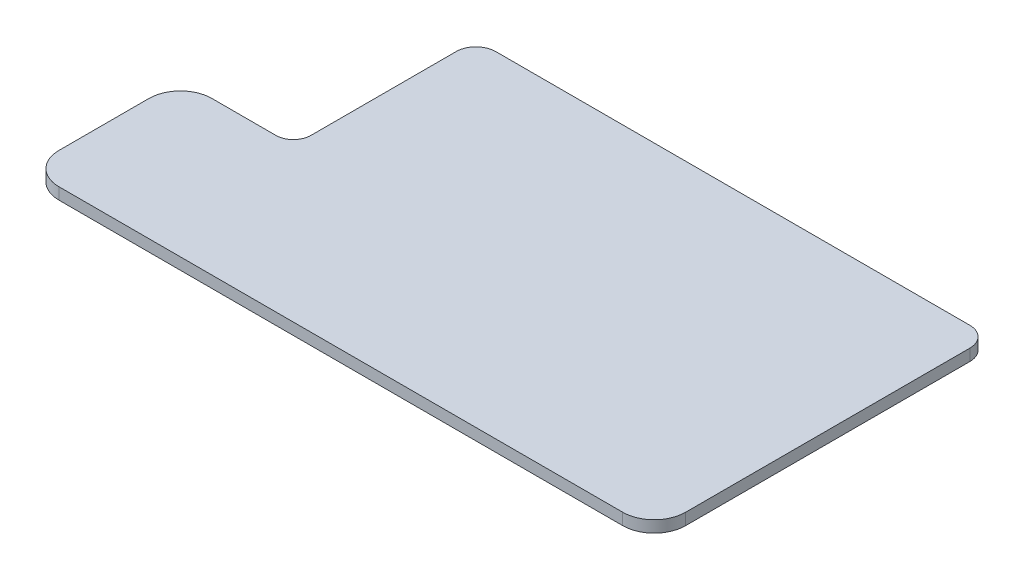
ISO-10303-21;
HEADER;
FILE_DESCRIPTION(('STEP AP214'),'2;1');
FILE_NAME('part.step','',(''),(''),'','','');
FILE_SCHEMA(('AUTOMOTIVE_DESIGN { 1 0 10303 214 1 1 1 1 }'));
ENDSEC;
DATA;
#1=APPLICATION_CONTEXT('core data for automotive mechanical design processes');
#2=APPLICATION_PROTOCOL_DEFINITION('international standard','automotive_design',2000,#1);
#3=PRODUCT_CONTEXT('',#1,'mechanical');
#4=PRODUCT('Part','Part','',(#3));
#5=PRODUCT_RELATED_PRODUCT_CATEGORY('part','',(#4));
#6=PRODUCT_DEFINITION_FORMATION('','',#4);
#7=PRODUCT_DEFINITION_CONTEXT('part definition',#1,'design');
#8=PRODUCT_DEFINITION('design','',#6,#7);
#9=PRODUCT_DEFINITION_SHAPE('','',#8);
#10=(LENGTH_UNIT() NAMED_UNIT(*) SI_UNIT(.MILLI.,.METRE.));
#11=(NAMED_UNIT(*) PLANE_ANGLE_UNIT() SI_UNIT($,.RADIAN.));
#12=(NAMED_UNIT(*) SI_UNIT($,.STERADIAN.) SOLID_ANGLE_UNIT());
#13=UNCERTAINTY_MEASURE_WITH_UNIT(LENGTH_MEASURE(1.E-05),#10,'distance_accuracy_value','');
#14=(GEOMETRIC_REPRESENTATION_CONTEXT(3) GLOBAL_UNCERTAINTY_ASSIGNED_CONTEXT((#13)) GLOBAL_UNIT_ASSIGNED_CONTEXT((#10,
#11,#12)) REPRESENTATION_CONTEXT('',''));
#15=CARTESIAN_POINT('',(0.,0.,0.));
#16=DIRECTION('',(0.,0.,1.));
#17=DIRECTION('',(1.,0.,0.));
#18=AXIS2_PLACEMENT_3D('',#15,#16,#17);
#19=CARTESIAN_POINT('',(26.9,-1.,-14.4));
#20=DIRECTION('',(1.,0.,0.));
#21=DIRECTION('',(0.,0.,-1.));
#22=AXIS2_PLACEMENT_3D('',#19,#20,#21);
#23=PLANE('',#22);
#24=DIRECTION('',(0.,0.,-1.));
#25=VECTOR('',#24,1.);
#26=CARTESIAN_POINT('',(26.9,0.,-14.4));
#27=LINE('',#26,#25);
#28=CARTESIAN_POINT('',(26.9,0.,11.7));
#29=VERTEX_POINT('',#28);
#30=CARTESIAN_POINT('',(26.9,0.,-12.7));
#31=VERTEX_POINT('',#30);
#32=EDGE_CURVE('E130',#29,#31,#27,.T.);
#33=ORIENTED_EDGE('',*,*,#32,.F.);
#34=DIRECTION('',(0.,1.,0.));
#35=VECTOR('',#34,1.);
#36=CARTESIAN_POINT('',(26.9,-1.,11.7));
#37=LINE('',#36,#35);
#38=CARTESIAN_POINT('',(26.9,-1.,11.7));
#39=VERTEX_POINT('',#38);
#40=EDGE_CURVE('E202',#29,#39,#37,.F.);
#41=ORIENTED_EDGE('',*,*,#40,.T.);
#42=DIRECTION('',(0.,0.,-1.));
#43=VECTOR('',#42,1.);
#44=CARTESIAN_POINT('',(26.9,-1.,-14.4));
#45=LINE('',#44,#43);
#46=CARTESIAN_POINT('',(26.9,-1.,-12.7));
#47=VERTEX_POINT('',#46);
#48=EDGE_CURVE('E157',#39,#47,#45,.T.);
#49=ORIENTED_EDGE('',*,*,#48,.T.);
#50=DIRECTION('',(0.,1.,0.));
#51=VECTOR('',#50,1.);
#52=CARTESIAN_POINT('',(26.9,-1.,-12.7));
#53=LINE('',#52,#51);
#54=EDGE_CURVE('E150',#47,#31,#53,.T.);
#55=ORIENTED_EDGE('',*,*,#54,.T.);
#56=EDGE_LOOP('',(#33,#41,#49,#55));
#57=FACE_BOUND('',#56,.T.);
#58=ADVANCED_FACE('F42',(#57),#23,.T.);
#59=CARTESIAN_POINT('',(-26.9,-1.,14.4));
#60=DIRECTION('',(0.,0.,1.));
#61=DIRECTION('',(1.,0.,0.));
#62=AXIS2_PLACEMENT_3D('',#59,#60,#61);
#63=PLANE('',#62);
#64=DIRECTION('',(1.,0.,0.));
#65=VECTOR('',#64,1.);
#66=CARTESIAN_POINT('',(-26.9,-1.,14.4));
#67=LINE('',#66,#65);
#68=CARTESIAN_POINT('',(-24.2,-1.,14.4));
#69=VERTEX_POINT('',#68);
#70=CARTESIAN_POINT('',(24.2,-1.,14.4));
#71=VERTEX_POINT('',#70);
#72=EDGE_CURVE('E247',#69,#71,#67,.T.);
#73=ORIENTED_EDGE('',*,*,#72,.T.);
#74=DIRECTION('',(0.,1.,0.));
#75=VECTOR('',#74,1.);
#76=CARTESIAN_POINT('',(24.2,-1.,14.4));
#77=LINE('',#76,#75);
#78=CARTESIAN_POINT('',(24.2,0.,14.4));
#79=VERTEX_POINT('',#78);
#80=EDGE_CURVE('E190',#71,#79,#77,.T.);
#81=ORIENTED_EDGE('',*,*,#80,.T.);
#82=DIRECTION('',(1.,0.,0.));
#83=VECTOR('',#82,1.);
#84=CARTESIAN_POINT('',(-26.9,0.,14.4));
#85=LINE('',#84,#83);
#86=CARTESIAN_POINT('',(-24.2,0.,14.4));
#87=VERTEX_POINT('',#86);
#88=EDGE_CURVE('E239',#87,#79,#85,.T.);
#89=ORIENTED_EDGE('',*,*,#88,.F.);
#90=DIRECTION('',(0.,1.,0.));
#91=VECTOR('',#90,1.);
#92=CARTESIAN_POINT('',(-24.2,-1.,14.4));
#93=LINE('',#92,#91);
#94=EDGE_CURVE('E187',#87,#69,#93,.F.);
#95=ORIENTED_EDGE('',*,*,#94,.T.);
#96=EDGE_LOOP('',(#73,#81,#89,#95));
#97=FACE_BOUND('',#96,.T.);
#98=ADVANCED_FACE('F278',(#97),#63,.T.);
#99=CARTESIAN_POINT('',(-26.9,-1.,-14.4));
#100=DIRECTION('',(-1.,0.,0.));
#101=DIRECTION('',(0.,0.,1.));
#102=AXIS2_PLACEMENT_3D('',#99,#100,#101);
#103=PLANE('',#102);
#104=DIRECTION('',(0.,0.,1.));
#105=VECTOR('',#104,1.);
#106=CARTESIAN_POINT('',(-26.9,-1.,-14.4));
#107=LINE('',#106,#105);
#108=CARTESIAN_POINT('',(-26.9,-1.,3.97050000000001));
#109=VERTEX_POINT('',#108);
#110=CARTESIAN_POINT('',(-26.9,-1.,11.7));
#111=VERTEX_POINT('',#110);
#112=EDGE_CURVE('E243',#109,#111,#107,.T.);
#113=ORIENTED_EDGE('',*,*,#112,.T.);
#114=DIRECTION('',(0.,1.,0.));
#115=VECTOR('',#114,1.);
#116=CARTESIAN_POINT('',(-26.9,-1.,11.7));
#117=LINE('',#116,#115);
#118=CARTESIAN_POINT('',(-26.9,0.,11.7));
#119=VERTEX_POINT('',#118);
#120=EDGE_CURVE('E219',#111,#119,#117,.T.);
#121=ORIENTED_EDGE('',*,*,#120,.T.);
#122=DIRECTION('',(0.,0.,1.));
#123=VECTOR('',#122,1.);
#124=CARTESIAN_POINT('',(-26.9,0.,-14.4));
#125=LINE('',#124,#123);
#126=CARTESIAN_POINT('',(-26.9,0.,3.97050000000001));
#127=VERTEX_POINT('',#126);
#128=EDGE_CURVE('E253',#127,#119,#125,.T.);
#129=ORIENTED_EDGE('',*,*,#128,.F.);
#130=DIRECTION('',(0.,-1.,0.));
#131=VECTOR('',#130,1.);
#132=CARTESIAN_POINT('',(-26.9,-1.,3.97050000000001));
#133=LINE('',#132,#131);
#134=EDGE_CURVE('E215',#127,#109,#133,.T.);
#135=ORIENTED_EDGE('',*,*,#134,.T.);
#136=EDGE_LOOP('',(#113,#121,#129,#135));
#137=FACE_BOUND('',#136,.T.);
#138=ADVANCED_FACE('F271',(#137),#103,.T.);
#139=CARTESIAN_POINT('',(-26.9,-1.,-14.4));
#140=DIRECTION('',(0.,0.,-1.));
#141=DIRECTION('',(-1.,0.,0.));
#142=AXIS2_PLACEMENT_3D('',#139,#140,#141);
#143=PLANE('',#142);
#144=DIRECTION('',(-1.,0.,0.));
#145=VECTOR('',#144,1.);
#146=CARTESIAN_POINT('',(-26.9,0.,-14.4));
#147=LINE('',#146,#145);
#148=CARTESIAN_POINT('',(25.2,0.,-14.4));
#149=VERTEX_POINT('',#148);
#150=CARTESIAN_POINT('',(-15.5,0.,-14.4));
#151=VERTEX_POINT('',#150);
#152=EDGE_CURVE('E142',#149,#151,#147,.T.);
#153=ORIENTED_EDGE('',*,*,#152,.F.);
#154=DIRECTION('',(0.,1.,0.));
#155=VECTOR('',#154,1.);
#156=CARTESIAN_POINT('',(25.2,-1.,-14.4));
#157=LINE('',#156,#155);
#158=CARTESIAN_POINT('',(25.2,-1.,-14.4));
#159=VERTEX_POINT('',#158);
#160=EDGE_CURVE('E151',#149,#159,#157,.F.);
#161=ORIENTED_EDGE('',*,*,#160,.T.);
#162=DIRECTION('',(-1.,0.,0.));
#163=VECTOR('',#162,1.);
#164=CARTESIAN_POINT('',(-26.9,-1.,-14.4));
#165=LINE('',#164,#163);
#166=CARTESIAN_POINT('',(-15.5,-1.,-14.4));
#167=VERTEX_POINT('',#166);
#168=EDGE_CURVE('E238',#159,#167,#165,.T.);
#169=ORIENTED_EDGE('',*,*,#168,.T.);
#170=DIRECTION('',(0.,-1.,0.));
#171=VECTOR('',#170,1.);
#172=CARTESIAN_POINT('',(-15.5,0.,-14.4));
#173=LINE('',#172,#171);
#174=EDGE_CURVE('E153',#167,#151,#173,.F.);
#175=ORIENTED_EDGE('',*,*,#174,.T.);
#176=EDGE_LOOP('',(#153,#161,#169,#175));
#177=FACE_BOUND('',#176,.T.);
#178=ADVANCED_FACE('F269',(#177),#143,.T.);
#179=CARTESIAN_POINT('',(0.,-1.,0.));
#180=DIRECTION('',(0.,1.,0.));
#181=DIRECTION('',(0.,0.,1.));
#182=AXIS2_PLACEMENT_3D('',#179,#180,#181);
#183=PLANE('',#182);
#184=ORIENTED_EDGE('',*,*,#48,.F.);
#185=CARTESIAN_POINT('',(24.2,-1.,11.7));
#186=DIRECTION('',(0.,1.,0.));
#187=DIRECTION('',(0.,0.,1.));
#188=AXIS2_PLACEMENT_3D('',#185,#186,#187);
#189=CIRCLE('',#188,2.7);
#190=EDGE_CURVE('E212',#39,#71,#189,.F.);
#191=ORIENTED_EDGE('',*,*,#190,.T.);
#192=ORIENTED_EDGE('',*,*,#72,.F.);
#193=CARTESIAN_POINT('',(-24.2,-1.,11.7));
#194=DIRECTION('',(0.,1.,0.));
#195=DIRECTION('',(0.,0.,1.));
#196=AXIS2_PLACEMENT_3D('',#193,#194,#195);
#197=CIRCLE('',#196,2.7);
#198=EDGE_CURVE('E209',#69,#111,#197,.F.);
#199=ORIENTED_EDGE('',*,*,#198,.T.);
#200=ORIENTED_EDGE('',*,*,#112,.F.);
#201=CARTESIAN_POINT('',(-24.2,-1.,3.97050000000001));
#202=DIRECTION('',(0.,1.,0.));
#203=DIRECTION('',(0.,0.,1.));
#204=AXIS2_PLACEMENT_3D('',#201,#202,#203);
#205=CIRCLE('',#204,2.7);
#206=CARTESIAN_POINT('',(-24.2,-1.,1.27050000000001));
#207=VERTEX_POINT('',#206);
#208=EDGE_CURVE('E205',#109,#207,#205,.F.);
#209=ORIENTED_EDGE('',*,*,#208,.T.);
#210=DIRECTION('',(-1.,0.,0.));
#211=VECTOR('',#210,1.);
#212=CARTESIAN_POINT('',(-26.9,-1.,1.27050000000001));
#213=LINE('',#212,#211);
#214=CARTESIAN_POINT('',(-18.7,-1.,1.27050000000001));
#215=VERTEX_POINT('',#214);
#216=EDGE_CURVE('E143',#215,#207,#213,.T.);
#217=ORIENTED_EDGE('',*,*,#216,.F.);
#218=CARTESIAN_POINT('',(-18.7,-1.,-0.229499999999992));
#219=DIRECTION('',(0.,1.,0.));
#220=DIRECTION('',(0.,0.,1.));
#221=AXIS2_PLACEMENT_3D('',#218,#219,#220);
#222=CIRCLE('',#221,1.5);
#223=CARTESIAN_POINT('',(-17.2,-1.,-0.229499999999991));
#224=VERTEX_POINT('',#223);
#225=EDGE_CURVE('E51',#215,#224,#222,.T.);
#226=ORIENTED_EDGE('',*,*,#225,.T.);
#227=DIRECTION('',(0.,0.,1.));
#228=VECTOR('',#227,1.);
#229=CARTESIAN_POINT('',(-17.2,-1.,1.27050000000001));
#230=LINE('',#229,#228);
#231=CARTESIAN_POINT('',(-17.2,-1.,-12.7));
#232=VERTEX_POINT('',#231);
#233=EDGE_CURVE('E231',#232,#224,#230,.T.);
#234=ORIENTED_EDGE('',*,*,#233,.F.);
#235=CARTESIAN_POINT('',(-15.5,-1.,-12.7));
#236=DIRECTION('',(0.,1.,0.));
#237=DIRECTION('',(0.,0.,1.));
#238=AXIS2_PLACEMENT_3D('',#235,#236,#237);
#239=CIRCLE('',#238,1.7);
#240=EDGE_CURVE('E177',#232,#167,#239,.F.);
#241=ORIENTED_EDGE('',*,*,#240,.T.);
#242=ORIENTED_EDGE('',*,*,#168,.F.);
#243=CARTESIAN_POINT('',(25.2,-1.,-12.7));
#244=DIRECTION('',(0.,1.,0.));
#245=DIRECTION('',(0.,0.,1.));
#246=AXIS2_PLACEMENT_3D('',#243,#244,#245);
#247=CIRCLE('',#246,1.7);
#248=EDGE_CURVE('E180',#159,#47,#247,.F.);
#249=ORIENTED_EDGE('',*,*,#248,.T.);
#250=EDGE_LOOP('',(#184,#191,#192,#199,#200,#209,#217,#226,#234,#241,#242,#249));
#251=FACE_BOUND('',#250,.T.);
#252=ADVANCED_FACE('F267',(#251),#183,.F.);
#253=CARTESIAN_POINT('',(0.,0.,0.));
#254=DIRECTION('',(0.,1.,0.));
#255=DIRECTION('',(0.,0.,1.));
#256=AXIS2_PLACEMENT_3D('',#253,#254,#255);
#257=PLANE('',#256);
#258=ORIENTED_EDGE('',*,*,#88,.T.);
#259=CARTESIAN_POINT('',(24.2,0.,11.7));
#260=DIRECTION('',(0.,1.,0.));
#261=DIRECTION('',(0.,0.,1.));
#262=AXIS2_PLACEMENT_3D('',#259,#260,#261);
#263=CIRCLE('',#262,2.7);
#264=EDGE_CURVE('E137',#79,#29,#263,.T.);
#265=ORIENTED_EDGE('',*,*,#264,.T.);
#266=ORIENTED_EDGE('',*,*,#32,.T.);
#267=CARTESIAN_POINT('',(25.2,0.,-12.7));
#268=DIRECTION('',(0.,1.,0.));
#269=DIRECTION('',(0.,0.,1.));
#270=AXIS2_PLACEMENT_3D('',#267,#268,#269);
#271=CIRCLE('',#270,1.7);
#272=EDGE_CURVE('E135',#31,#149,#271,.T.);
#273=ORIENTED_EDGE('',*,*,#272,.T.);
#274=ORIENTED_EDGE('',*,*,#152,.T.);
#275=CARTESIAN_POINT('',(-15.5,0.,-12.7));
#276=DIRECTION('',(0.,1.,0.));
#277=DIRECTION('',(0.,0.,1.));
#278=AXIS2_PLACEMENT_3D('',#275,#276,#277);
#279=CIRCLE('',#278,1.7);
#280=CARTESIAN_POINT('',(-17.2,0.,-12.7));
#281=VERTEX_POINT('',#280);
#282=EDGE_CURVE('E154',#151,#281,#279,.T.);
#283=ORIENTED_EDGE('',*,*,#282,.T.);
#284=DIRECTION('',(0.,0.,-1.));
#285=VECTOR('',#284,1.);
#286=CARTESIAN_POINT('',(-17.2,0.,0.));
#287=LINE('',#286,#285);
#288=CARTESIAN_POINT('',(-17.2,0.,-0.229499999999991));
#289=VERTEX_POINT('',#288);
#290=EDGE_CURVE('E169',#289,#281,#287,.T.);
#291=ORIENTED_EDGE('',*,*,#290,.F.);
#292=CARTESIAN_POINT('',(-18.7,0.,-0.229499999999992));
#293=DIRECTION('',(0.,1.,0.));
#294=DIRECTION('',(0.,0.,1.));
#295=AXIS2_PLACEMENT_3D('',#292,#293,#294);
#296=CIRCLE('',#295,1.5);
#297=CARTESIAN_POINT('',(-18.7,0.,1.27050000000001));
#298=VERTEX_POINT('',#297);
#299=EDGE_CURVE('E11',#289,#298,#296,.F.);
#300=ORIENTED_EDGE('',*,*,#299,.T.);
#301=DIRECTION('',(1.,0.,0.));
#302=VECTOR('',#301,1.);
#303=CARTESIAN_POINT('',(0.,0.,1.27050000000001));
#304=LINE('',#303,#302);
#305=CARTESIAN_POINT('',(-24.2,0.,1.27050000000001));
#306=VERTEX_POINT('',#305);
#307=EDGE_CURVE('E160',#306,#298,#304,.T.);
#308=ORIENTED_EDGE('',*,*,#307,.F.);
#309=CARTESIAN_POINT('',(-24.2,0.,3.97050000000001));
#310=DIRECTION('',(0.,1.,0.));
#311=DIRECTION('',(0.,0.,1.));
#312=AXIS2_PLACEMENT_3D('',#309,#310,#311);
#313=CIRCLE('',#312,2.7);
#314=EDGE_CURVE('E194',#306,#127,#313,.T.);
#315=ORIENTED_EDGE('',*,*,#314,.T.);
#316=ORIENTED_EDGE('',*,*,#128,.T.);
#317=CARTESIAN_POINT('',(-24.2,0.,11.7));
#318=DIRECTION('',(0.,1.,0.));
#319=DIRECTION('',(0.,0.,1.));
#320=AXIS2_PLACEMENT_3D('',#317,#318,#319);
#321=CIRCLE('',#320,2.7);
#322=EDGE_CURVE('E197',#119,#87,#321,.T.);
#323=ORIENTED_EDGE('',*,*,#322,.T.);
#324=EDGE_LOOP('',(#258,#265,#266,#273,#274,#283,#291,#300,#308,#315,#316,#323));
#325=FACE_BOUND('',#324,.T.);
#326=ADVANCED_FACE('F133',(#325),#257,.T.);
#327=CARTESIAN_POINT('',(-26.9,1.5,1.27050000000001));
#328=DIRECTION('',(0.,0.,1.));
#329=DIRECTION('',(1.,0.,0.));
#330=AXIS2_PLACEMENT_3D('',#327,#328,#329);
#331=PLANE('',#330);
#332=ORIENTED_EDGE('',*,*,#307,.T.);
#333=DIRECTION('',(0.,-1.,0.));
#334=VECTOR('',#333,1.);
#335=CARTESIAN_POINT('',(-18.7,-1.,1.27050000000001));
#336=LINE('',#335,#334);
#337=EDGE_CURVE('E225',#298,#215,#336,.T.);
#338=ORIENTED_EDGE('',*,*,#337,.T.);
#339=ORIENTED_EDGE('',*,*,#216,.T.);
#340=DIRECTION('',(0.,-1.,0.));
#341=VECTOR('',#340,1.);
#342=CARTESIAN_POINT('',(-24.2,0.,1.27050000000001));
#343=LINE('',#342,#341);
#344=EDGE_CURVE('E222',#207,#306,#343,.F.);
#345=ORIENTED_EDGE('',*,*,#344,.T.);
#346=EDGE_LOOP('',(#332,#338,#339,#345));
#347=FACE_BOUND('',#346,.T.);
#348=ADVANCED_FACE('F321',(#347),#331,.F.);
#349=CARTESIAN_POINT('',(-17.2,1.5,1.27050000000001));
#350=DIRECTION('',(1.,0.,0.));
#351=DIRECTION('',(0.,0.,-1.));
#352=AXIS2_PLACEMENT_3D('',#349,#350,#351);
#353=PLANE('',#352);
#354=ORIENTED_EDGE('',*,*,#233,.T.);
#355=DIRECTION('',(0.,-1.,0.));
#356=VECTOR('',#355,1.);
#357=CARTESIAN_POINT('',(-17.2,0.,-0.229499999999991));
#358=LINE('',#357,#356);
#359=EDGE_CURVE('E64',#224,#289,#358,.F.);
#360=ORIENTED_EDGE('',*,*,#359,.T.);
#361=ORIENTED_EDGE('',*,*,#290,.T.);
#362=DIRECTION('',(0.,-1.,0.));
#363=VECTOR('',#362,1.);
#364=CARTESIAN_POINT('',(-17.2,-1.,-12.7));
#365=LINE('',#364,#363);
#366=EDGE_CURVE('E183',#281,#232,#365,.T.);
#367=ORIENTED_EDGE('',*,*,#366,.T.);
#368=EDGE_LOOP('',(#354,#360,#361,#367));
#369=FACE_BOUND('',#368,.T.);
#370=ADVANCED_FACE('F259',(#369),#353,.F.);
#371=CARTESIAN_POINT('',(25.2,-1.,-12.7));
#372=DIRECTION('',(0.,1.,0.));
#373=DIRECTION('',(0.,0.,1.));
#374=AXIS2_PLACEMENT_3D('',#371,#372,#373);
#375=CYLINDRICAL_SURFACE('',#374,1.7);
#376=ORIENTED_EDGE('',*,*,#248,.F.);
#377=ORIENTED_EDGE('',*,*,#160,.F.);
#378=ORIENTED_EDGE('',*,*,#272,.F.);
#379=ORIENTED_EDGE('',*,*,#54,.F.);
#380=EDGE_LOOP('',(#376,#377,#378,#379));
#381=FACE_BOUND('',#380,.T.);
#382=ADVANCED_FACE('F149',(#381),#375,.T.);
#383=CARTESIAN_POINT('',(-15.5,1.5,-12.7));
#384=DIRECTION('',(0.,1.,0.));
#385=DIRECTION('',(0.,0.,1.));
#386=AXIS2_PLACEMENT_3D('',#383,#384,#385);
#387=CYLINDRICAL_SURFACE('',#386,1.7);
#388=ORIENTED_EDGE('',*,*,#282,.F.);
#389=ORIENTED_EDGE('',*,*,#174,.F.);
#390=ORIENTED_EDGE('',*,*,#240,.F.);
#391=ORIENTED_EDGE('',*,*,#366,.F.);
#392=EDGE_LOOP('',(#388,#389,#390,#391));
#393=FACE_BOUND('',#392,.T.);
#394=ADVANCED_FACE('F265',(#393),#387,.T.);
#395=CARTESIAN_POINT('',(24.2,-1.,11.7));
#396=DIRECTION('',(0.,1.,0.));
#397=DIRECTION('',(0.,0.,1.));
#398=AXIS2_PLACEMENT_3D('',#395,#396,#397);
#399=CYLINDRICAL_SURFACE('',#398,2.7);
#400=ORIENTED_EDGE('',*,*,#190,.F.);
#401=ORIENTED_EDGE('',*,*,#40,.F.);
#402=ORIENTED_EDGE('',*,*,#264,.F.);
#403=ORIENTED_EDGE('',*,*,#80,.F.);
#404=EDGE_LOOP('',(#400,#401,#402,#403));
#405=FACE_BOUND('',#404,.T.);
#406=ADVANCED_FACE('F293',(#405),#399,.T.);
#407=CARTESIAN_POINT('',(-24.2,-1.,11.7));
#408=DIRECTION('',(0.,1.,0.));
#409=DIRECTION('',(0.,0.,1.));
#410=AXIS2_PLACEMENT_3D('',#407,#408,#409);
#411=CYLINDRICAL_SURFACE('',#410,2.7);
#412=ORIENTED_EDGE('',*,*,#198,.F.);
#413=ORIENTED_EDGE('',*,*,#94,.F.);
#414=ORIENTED_EDGE('',*,*,#322,.F.);
#415=ORIENTED_EDGE('',*,*,#120,.F.);
#416=EDGE_LOOP('',(#412,#413,#414,#415));
#417=FACE_BOUND('',#416,.T.);
#418=ADVANCED_FACE('F296',(#417),#411,.T.);
#419=CARTESIAN_POINT('',(-24.2,-1.,3.97050000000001));
#420=DIRECTION('',(0.,1.,0.));
#421=DIRECTION('',(0.,0.,1.));
#422=AXIS2_PLACEMENT_3D('',#419,#420,#421);
#423=CYLINDRICAL_SURFACE('',#422,2.7);
#424=ORIENTED_EDGE('',*,*,#314,.F.);
#425=ORIENTED_EDGE('',*,*,#344,.F.);
#426=ORIENTED_EDGE('',*,*,#208,.F.);
#427=ORIENTED_EDGE('',*,*,#134,.F.);
#428=EDGE_LOOP('',(#424,#425,#426,#427));
#429=FACE_BOUND('',#428,.T.);
#430=ADVANCED_FACE('F299',(#429),#423,.T.);
#431=CARTESIAN_POINT('',(-18.7,1.5,-0.229499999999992));
#432=DIRECTION('',(0.,1.,0.));
#433=DIRECTION('',(0.,0.,1.));
#434=AXIS2_PLACEMENT_3D('',#431,#432,#433);
#435=CYLINDRICAL_SURFACE('',#434,1.5);
#436=ORIENTED_EDGE('',*,*,#299,.F.);
#437=ORIENTED_EDGE('',*,*,#359,.F.);
#438=ORIENTED_EDGE('',*,*,#225,.F.);
#439=ORIENTED_EDGE('',*,*,#337,.F.);
#440=EDGE_LOOP('',(#436,#437,#438,#439));
#441=FACE_BOUND('',#440,.T.);
#442=ADVANCED_FACE('F44',(#441),#435,.F.);
#443=CLOSED_SHELL('',(#58,#98,#138,#178,#252,#326,#348,#370,#382,#394,#406,#418,#430,#442));
#444=MANIFOLD_SOLID_BREP('B2',#443);
#445=ADVANCED_BREP_SHAPE_REPRESENTATION('',(#18,#444),#14);
#446=SHAPE_DEFINITION_REPRESENTATION(#9,#445);
ENDSEC;
END-ISO-10303-21;
